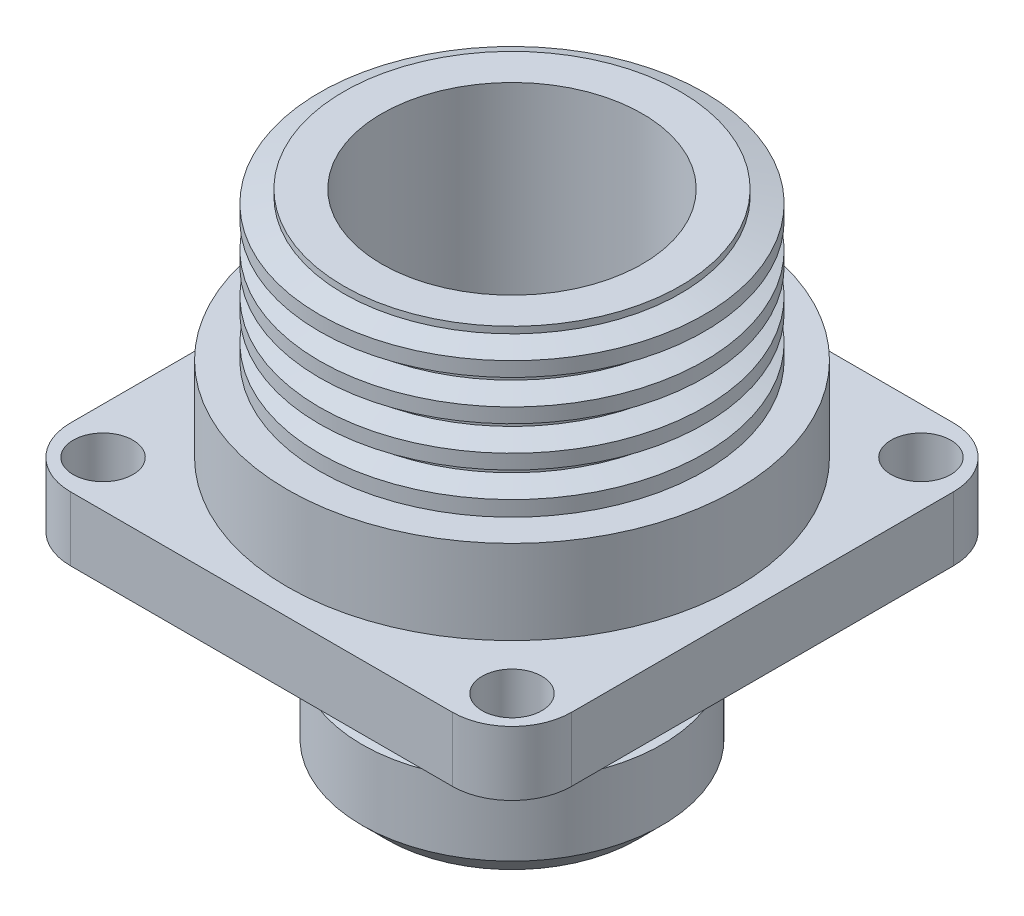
from build123d import *

# Parameters (mm, degrees)
SKETCH1_W           = 31.75
SKETCH1_H           = 31.75
SKETCH1_R           = 1.8923
BASE_EXTRUDE_DEPTH  = 4.064
SKETCH3_R           = 9.4996
BOSS_EXTRUDE2_DEPTH = 12.954
CHAMFER1_SIZE       = 1.5748
FILLET1_R           = 3.7846
SKETCH2_R           = 14.224
EXTRUDE1_DEPTH      = 5.334
SKETCH12_R          = 12.192
EXTRUDE2_DEPTH      = 9.398
SKETCH14_R          = 8.255
CUT_EXTRUDE1_DEPTH  = 14.478
SKETCH15_R          = 6.50202821
CUT_EXTRUDE2_DEPTH  = 7.62


with BuildPart() as part:
    # Sketch1 → Base-Extrude (new body)
    with BuildSketch(Plane(origin=(0, 0, 0), x_dir=(1, 0, 0), z_dir=(0, 1, 0))):
        Rectangle(SKETCH1_W, SKETCH1_H)
        with Locations(Location((-12.954, 12.954, 0), (0, 0, 270))):
            Circle(SKETCH1_R, mode=Mode.SUBTRACT)
        with Locations(Location((12.954, 12.954, 0), (0, 0, 90))):
            Circle(SKETCH1_R, mode=Mode.SUBTRACT)
        with Locations(Location((12.954, -12.954, 0), (0, 0, 270))):
            Circle(SKETCH1_R, mode=Mode.SUBTRACT)
        with Locations(Location((-12.954, -12.954, 0), (0, 0, 90))):
            Circle(SKETCH1_R, mode=Mode.SUBTRACT)
    extrude(amount=BASE_EXTRUDE_DEPTH)

    # Sketch3 → Boss-Extrude2 (add)
    with BuildSketch(Plane.XZ):
        with Locations(Location((0, 0, 0), (0, 0, 90))):
            Circle(SKETCH3_R)
    extrude(amount=BOSS_EXTRUDE2_DEPTH)

    # Chamfer1
    chamfer1_edges = [part.edges().sort_by_distance(p)[0] for p in [
        (0, -12.954, -9.4996),
    ]]
    chamfer(chamfer1_edges, length=CHAMFER1_SIZE)

    # Fillet1
    fillet1_edges = [part.edges().sort_by_distance(p)[0] for p in [
        (-15.875, 2.032, -15.875),
        (15.875, 2.032, -15.875),
        (15.875, 2.032, 15.875),
        (-15.875, 2.032, 15.875),
    ]]
    fillet(fillet1_edges, radius=FILLET1_R)

    # Sketch11 → Groove for AS 568-016_ O-Ring1 (revolve, cut)
    with BuildSketch(Plane(origin=(0, -12.954, 0), x_dir=(0, 0, 1), z_dir=(-1, 0, 0)), mode=Mode.PRIVATE) as groove_for_as_568_016_o_ring1_sk:
        with BuildLine():
            Line((8.486862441, 8.4582), (9.6139, 8.55680301))
            Line((9.6139, 8.55680301), (9.6139, 5.99739699))
            Line((9.6139, 5.99739699), (8.486862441, 6.096))
            ThreePointArc((8.486862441, 6.096), (8.321731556, 6.177433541), (8.255, 6.349033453))
            Line((8.255, 6.349033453), (8.255, 8.205166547))
            ThreePointArc((8.255, 8.205166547), (8.321731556, 8.376766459), (8.486862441, 8.4582))
        make_face()
    revolve(groove_for_as_568_016_o_ring1_sk.sketch.rotate(Axis((0, 37.046, 0), (0, -1, 0)), 180), axis=Axis((0, 37.046, 0), (0, -1, 0)), mode=Mode.SUBTRACT)

    # Sketch2 → Extrude1 (add)
    with BuildSketch(Plane(origin=(0, 4.064, 0), x_dir=(-1, 0, 0), z_dir=(0, 1, 0))):
        with Locations(Location((0, 0, 0), (0, 0, 90))):
            Circle(SKETCH2_R)
    extrude(amount=EXTRUDE1_DEPTH)

    # Sketch12 → Extrude2 (add)
    with BuildSketch(Plane(origin=(0, 9.398, 0), x_dir=(-1, 0, 0), z_dir=(0, 1, 0))):
        with Locations(Location((0, 0, 0), (0, 0, 90))):
            Circle(SKETCH12_R)
    extrude(amount=EXTRUDE2_DEPTH)

    # Sketch13 → Cut-Revolve5 (revolve, cut)
    with BuildSketch(Plane.XY, mode=Mode.PRIVATE) as cut_revolve5_sk:
        Polygon((10.668, 19.210952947), (10.668, 18.381047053), (12.192, 17.986913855), (12.192, 17.065086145), (10.668, 16.670952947), (10.668, 15.841047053), (12.192, 15.446913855), (12.192, 14.525086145), (10.668, 14.130952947), (10.668, 13.301047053), (12.192, 12.906913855), (12.192, 11.985086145), (10.668, 11.590952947), (10.668, 10.761047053), (12.192, 10.366913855), (13.877852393, 10.366913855), (13.877852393, 19.605086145), (12.192, 19.605086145), align=None)
    revolve(cut_revolve5_sk.sketch.rotate(Axis((0, 0, 0), (0, 1, 0)), 90), axis=Axis((0, 0, 0), (0, 1, 0)), mode=Mode.SUBTRACT)

    # Sketch14 → Cut-Extrude1 (cut)
    with BuildSketch(Plane(origin=(0, 18.796, 0), x_dir=(-1, 0, 0), z_dir=(0, 1, 0))):
        with Locations(Location((0, 0, 0), (0, 0, 270))):
            Circle(SKETCH14_R)
    extrude(amount=-CUT_EXTRUDE1_DEPTH, mode=Mode.SUBTRACT)

    # Sketch15 → Cut-Extrude2 (cut)
    with BuildSketch(Plane.XZ.offset(12.954)):
        with Locations(Location((0, 0, 0), (0, 0, 270))):
            Circle(SKETCH15_R)
    extrude(amount=-CUT_EXTRUDE2_DEPTH, mode=Mode.SUBTRACT)

    # Sketch16 → Cut-Revolve6 (revolve, cut)
    with BuildSketch(Plane(origin=(0, 0, 0), x_dir=(0, 0, -1), z_dir=(1, 0, 0)), mode=Mode.PRIVATE) as cut_revolve6_sk:
        with BuildLine():
            Line((13.183475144, 0), (13.050524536, 0))
            ThreePointArc((13.050524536, 0), (12.964890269, 0.03321422), (12.924047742, 0.115483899))
            Line((12.924047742, 0.115483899), (12.824815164, 1.205316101))
            ThreePointArc((12.824815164, 1.205316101), (12.783972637, 1.28758578), (12.698338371, 1.3208))
            Line((12.698338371, 1.3208), (10.288661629, 1.3208))
            ThreePointArc((10.288661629, 1.3208), (10.203027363, 1.28758578), (10.162184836, 1.205316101))
            Line((10.162184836, 1.205316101), (10.062952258, 0.115483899))
            ThreePointArc((10.062952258, 0.115483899), (10.022109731, 0.03321422), (9.936475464, 0))
            Line((9.936475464, 0), (9.830781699, 0))
            Line((9.830781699, 0), (9.830781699, -0.57779242))
            Line((9.830781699, -0.57779242), (13.183475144, -0.57779242))
            Line((13.183475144, -0.57779242), (13.183475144, 0))
        make_face()
    revolve(cut_revolve6_sk.sketch.rotate(Axis((0, 0, 0), (0, -1, 0)), 180), axis=Axis((0, 0, 0), (0, -1, 0)), mode=Mode.SUBTRACT)


solid = part.part
